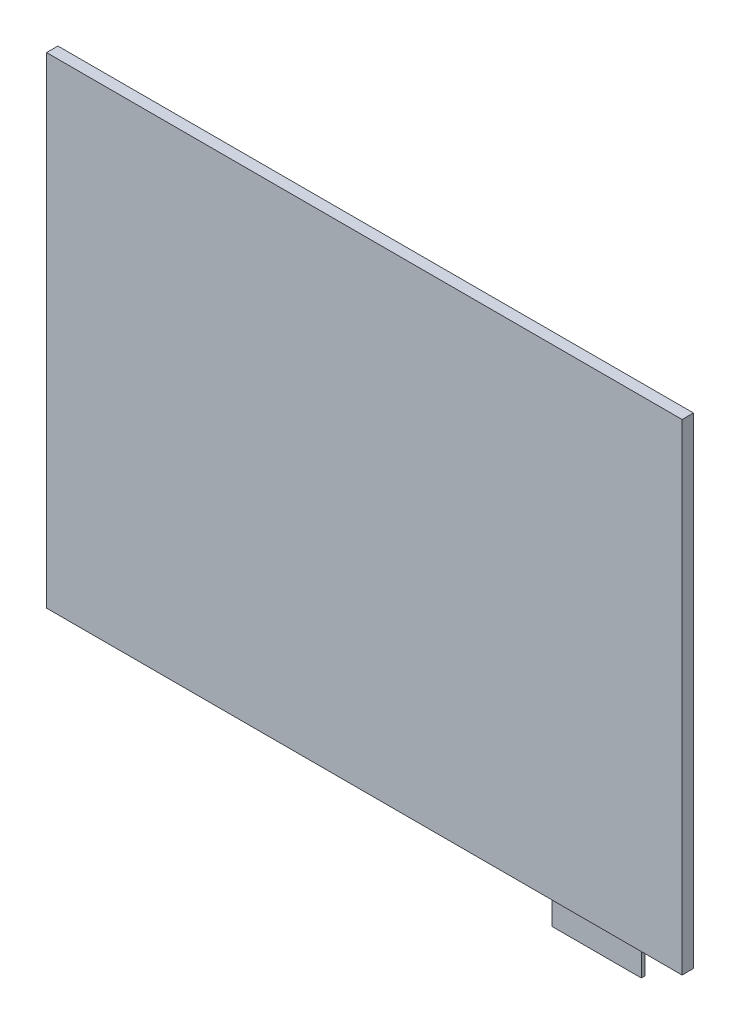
ISO-10303-21;
HEADER;
FILE_DESCRIPTION(('STEP AP214'),'2;1');
FILE_NAME('part.step','',(''),(''),'','','');
FILE_SCHEMA(('AUTOMOTIVE_DESIGN { 1 0 10303 214 1 1 1 1 }'));
ENDSEC;
DATA;
#1=APPLICATION_CONTEXT('core data for automotive mechanical design processes');
#2=APPLICATION_PROTOCOL_DEFINITION('international standard','automotive_design',2000,#1);
#3=PRODUCT_CONTEXT('',#1,'mechanical');
#4=PRODUCT('Part','Part','',(#3));
#5=PRODUCT_RELATED_PRODUCT_CATEGORY('part','',(#4));
#6=PRODUCT_DEFINITION_FORMATION('','',#4);
#7=PRODUCT_DEFINITION_CONTEXT('part definition',#1,'design');
#8=PRODUCT_DEFINITION('design','',#6,#7);
#9=PRODUCT_DEFINITION_SHAPE('','',#8);
#10=(LENGTH_UNIT() NAMED_UNIT(*) SI_UNIT(.MILLI.,.METRE.));
#11=(NAMED_UNIT(*) PLANE_ANGLE_UNIT() SI_UNIT($,.RADIAN.));
#12=(NAMED_UNIT(*) SI_UNIT($,.STERADIAN.) SOLID_ANGLE_UNIT());
#13=UNCERTAINTY_MEASURE_WITH_UNIT(LENGTH_MEASURE(1.E-05),#10,'distance_accuracy_value','');
#14=(GEOMETRIC_REPRESENTATION_CONTEXT(3) GLOBAL_UNCERTAINTY_ASSIGNED_CONTEXT((#13)) GLOBAL_UNIT_ASSIGNED_CONTEXT((#10,
#11,#12)) REPRESENTATION_CONTEXT('',''));
#15=CARTESIAN_POINT('',(0.,0.,0.));
#16=DIRECTION('',(0.,0.,1.));
#17=DIRECTION('',(1.,0.,0.));
#18=AXIS2_PLACEMENT_3D('',#15,#16,#17);
#19=CARTESIAN_POINT('',(177.719768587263,-134.540308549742,6.35));
#20=DIRECTION('',(0.,-1.,0.));
#21=DIRECTION('',(0.,0.,-1.));
#22=AXIS2_PLACEMENT_3D('',#19,#20,#21);
#23=PLANE('',#22);
#24=DIRECTION('',(0.,0.,-1.));
#25=VECTOR('',#24,1.);
#26=CARTESIAN_POINT('',(177.719768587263,-134.540308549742,6.35));
#27=LINE('',#26,#25);
#28=CARTESIAN_POINT('',(177.719768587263,-134.540308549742,6.35));
#29=VERTEX_POINT('',#28);
#30=CARTESIAN_POINT('',(177.719768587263,-134.540308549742,0.));
#31=VERTEX_POINT('',#30);
#32=EDGE_CURVE('E151',#29,#31,#27,.T.);
#33=ORIENTED_EDGE('',*,*,#32,.F.);
#34=DIRECTION('',(-1.,0.,0.));
#35=VECTOR('',#34,1.);
#36=CARTESIAN_POINT('',(177.719768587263,-134.540308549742,6.35));
#37=LINE('',#36,#35);
#38=CARTESIAN_POINT('',(-177.719768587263,-134.540308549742,6.35));
#39=VERTEX_POINT('',#38);
#40=EDGE_CURVE('E143',#29,#39,#37,.T.);
#41=ORIENTED_EDGE('',*,*,#40,.T.);
#42=DIRECTION('',(0.,0.,-1.));
#43=VECTOR('',#42,1.);
#44=CARTESIAN_POINT('',(-177.719768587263,-134.540308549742,6.35));
#45=LINE('',#44,#43);
#46=CARTESIAN_POINT('',(-177.719768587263,-134.540308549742,0.));
#47=VERTEX_POINT('',#46);
#48=EDGE_CURVE('E37',#39,#47,#45,.T.);
#49=ORIENTED_EDGE('',*,*,#48,.T.);
#50=DIRECTION('',(-1.,0.,0.));
#51=VECTOR('',#50,1.);
#52=CARTESIAN_POINT('',(177.719768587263,-134.540308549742,0.));
#53=LINE('',#52,#51);
#54=EDGE_CURVE('E131',#31,#47,#53,.T.);
#55=ORIENTED_EDGE('',*,*,#54,.F.);
#56=EDGE_LOOP('',(#33,#41,#49,#55));
#57=FACE_BOUND('',#56,.T.);
#58=DIRECTION('',(0.,0.,-1.));
#59=VECTOR('',#58,1.);
#60=CARTESIAN_POINT('',(102.719768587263,-134.540308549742,4.17500000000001));
#61=LINE('',#60,#59);
#62=CARTESIAN_POINT('',(102.719768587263,-134.540308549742,4.17500000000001));
#63=VERTEX_POINT('',#62);
#64=CARTESIAN_POINT('',(102.719768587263,-134.540308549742,2.17500000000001));
#65=VERTEX_POINT('',#64);
#66=EDGE_CURVE('E93',#63,#65,#61,.T.);
#67=ORIENTED_EDGE('',*,*,#66,.F.);
#68=DIRECTION('',(1.,0.,0.));
#69=VECTOR('',#68,1.);
#70=CARTESIAN_POINT('',(102.719768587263,-134.540308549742,4.17500000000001));
#71=LINE('',#70,#69);
#72=CARTESIAN_POINT('',(152.719768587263,-134.540308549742,4.17500000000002));
#73=VERTEX_POINT('',#72);
#74=EDGE_CURVE('E44',#63,#73,#71,.T.);
#75=ORIENTED_EDGE('',*,*,#74,.T.);
#76=DIRECTION('',(0.,0.,1.));
#77=VECTOR('',#76,1.);
#78=CARTESIAN_POINT('',(152.719768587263,-134.540308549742,2.17499999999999));
#79=LINE('',#78,#77);
#80=CARTESIAN_POINT('',(152.719768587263,-134.540308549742,2.17499999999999));
#81=VERTEX_POINT('',#80);
#82=EDGE_CURVE('E49',#81,#73,#79,.T.);
#83=ORIENTED_EDGE('',*,*,#82,.F.);
#84=DIRECTION('',(-1.,0.,0.));
#85=VECTOR('',#84,1.);
#86=CARTESIAN_POINT('',(152.719768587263,-134.540308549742,2.17499999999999));
#87=LINE('',#86,#85);
#88=EDGE_CURVE('E90',#81,#65,#87,.T.);
#89=ORIENTED_EDGE('',*,*,#88,.T.);
#90=EDGE_LOOP('',(#67,#75,#83,#89));
#91=FACE_BOUND('',#90,.T.);
#92=ADVANCED_FACE('F29',(#57,#91),#23,.T.);
#93=CARTESIAN_POINT('',(-177.719768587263,134.540308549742,6.35));
#94=DIRECTION('',(0.,1.,0.));
#95=DIRECTION('',(-1.,0.,0.));
#96=AXIS2_PLACEMENT_3D('',#93,#94,#95);
#97=PLANE('',#96);
#98=DIRECTION('',(0.,0.,-1.));
#99=VECTOR('',#98,1.);
#100=CARTESIAN_POINT('',(-177.719768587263,134.540308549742,6.35));
#101=LINE('',#100,#99);
#102=CARTESIAN_POINT('',(-177.719768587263,134.540308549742,6.35));
#103=VERTEX_POINT('',#102);
#104=CARTESIAN_POINT('',(-177.719768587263,134.540308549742,0.));
#105=VERTEX_POINT('',#104);
#106=EDGE_CURVE('E11',#103,#105,#101,.T.);
#107=ORIENTED_EDGE('',*,*,#106,.F.);
#108=DIRECTION('',(1.,0.,0.));
#109=VECTOR('',#108,1.);
#110=CARTESIAN_POINT('',(-177.719768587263,134.540308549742,6.35));
#111=LINE('',#110,#109);
#112=CARTESIAN_POINT('',(177.719768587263,134.540308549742,6.35));
#113=VERTEX_POINT('',#112);
#114=EDGE_CURVE('E137',#103,#113,#111,.T.);
#115=ORIENTED_EDGE('',*,*,#114,.T.);
#116=DIRECTION('',(0.,0.,-1.));
#117=VECTOR('',#116,1.);
#118=CARTESIAN_POINT('',(177.719768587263,134.540308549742,6.35));
#119=LINE('',#118,#117);
#120=CARTESIAN_POINT('',(177.719768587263,134.540308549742,0.));
#121=VERTEX_POINT('',#120);
#122=EDGE_CURVE('E149',#113,#121,#119,.T.);
#123=ORIENTED_EDGE('',*,*,#122,.T.);
#124=DIRECTION('',(1.,0.,0.));
#125=VECTOR('',#124,1.);
#126=CARTESIAN_POINT('',(-177.719768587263,134.540308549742,0.));
#127=LINE('',#126,#125);
#128=EDGE_CURVE('E125',#105,#121,#127,.T.);
#129=ORIENTED_EDGE('',*,*,#128,.F.);
#130=EDGE_LOOP('',(#107,#115,#123,#129));
#131=FACE_BOUND('',#130,.T.);
#132=ADVANCED_FACE('F164',(#131),#97,.T.);
#133=CARTESIAN_POINT('',(-177.719768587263,134.540308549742,6.35));
#134=DIRECTION('',(1.,0.,0.));
#135=DIRECTION('',(0.,0.,-1.));
#136=AXIS2_PLACEMENT_3D('',#133,#134,#135);
#137=PLANE('',#136);
#138=ORIENTED_EDGE('',*,*,#48,.F.);
#139=DIRECTION('',(0.,-1.,0.));
#140=VECTOR('',#139,1.);
#141=CARTESIAN_POINT('',(-177.719768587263,134.540308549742,6.35));
#142=LINE('',#141,#140);
#143=EDGE_CURVE('E146',#103,#39,#142,.T.);
#144=ORIENTED_EDGE('',*,*,#143,.F.);
#145=ORIENTED_EDGE('',*,*,#106,.T.);
#146=DIRECTION('',(0.,-1.,0.));
#147=VECTOR('',#146,1.);
#148=CARTESIAN_POINT('',(-177.719768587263,134.540308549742,0.));
#149=LINE('',#148,#147);
#150=EDGE_CURVE('E134',#105,#47,#149,.T.);
#151=ORIENTED_EDGE('',*,*,#150,.T.);
#152=EDGE_LOOP('',(#138,#144,#145,#151));
#153=FACE_BOUND('',#152,.T.);
#154=ADVANCED_FACE('F31',(#153),#137,.F.);
#155=CARTESIAN_POINT('',(177.719768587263,-134.540308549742,6.35));
#156=DIRECTION('',(-1.,0.,0.));
#157=DIRECTION('',(0.,-1.,0.));
#158=AXIS2_PLACEMENT_3D('',#155,#156,#157);
#159=PLANE('',#158);
#160=DIRECTION('',(0.,1.,0.));
#161=VECTOR('',#160,1.);
#162=CARTESIAN_POINT('',(177.719768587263,-134.540308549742,6.35));
#163=LINE('',#162,#161);
#164=EDGE_CURVE('E140',#29,#113,#163,.T.);
#165=ORIENTED_EDGE('',*,*,#164,.F.);
#166=ORIENTED_EDGE('',*,*,#32,.T.);
#167=DIRECTION('',(0.,1.,0.));
#168=VECTOR('',#167,1.);
#169=CARTESIAN_POINT('',(177.719768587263,-134.540308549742,0.));
#170=LINE('',#169,#168);
#171=EDGE_CURVE('E128',#31,#121,#170,.T.);
#172=ORIENTED_EDGE('',*,*,#171,.T.);
#173=ORIENTED_EDGE('',*,*,#122,.F.);
#174=EDGE_LOOP('',(#165,#166,#172,#173));
#175=FACE_BOUND('',#174,.T.);
#176=ADVANCED_FACE('F167',(#175),#159,.F.);
#177=CARTESIAN_POINT('',(177.719768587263,134.540308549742,6.35));
#178=DIRECTION('',(0.,0.,1.));
#179=DIRECTION('',(1.,0.,0.));
#180=AXIS2_PLACEMENT_3D('',#177,#178,#179);
#181=PLANE('',#180);
#182=ORIENTED_EDGE('',*,*,#114,.F.);
#183=ORIENTED_EDGE('',*,*,#143,.T.);
#184=ORIENTED_EDGE('',*,*,#40,.F.);
#185=ORIENTED_EDGE('',*,*,#164,.T.);
#186=EDGE_LOOP('',(#182,#183,#184,#185));
#187=FACE_BOUND('',#186,.T.);
#188=ADVANCED_FACE('F169',(#187),#181,.T.);
#189=CARTESIAN_POINT('',(177.719768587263,134.540308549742,0.));
#190=DIRECTION('',(0.,0.,1.));
#191=DIRECTION('',(1.,0.,0.));
#192=AXIS2_PLACEMENT_3D('',#189,#190,#191);
#193=PLANE('',#192);
#194=ORIENTED_EDGE('',*,*,#128,.T.);
#195=ORIENTED_EDGE('',*,*,#171,.F.);
#196=ORIENTED_EDGE('',*,*,#54,.T.);
#197=ORIENTED_EDGE('',*,*,#150,.F.);
#198=EDGE_LOOP('',(#194,#195,#196,#197));
#199=FACE_BOUND('',#198,.T.);
#200=ADVANCED_FACE('F160',(#199),#193,.F.);
#201=CARTESIAN_POINT('',(102.719768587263,-149.540308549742,4.17500000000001));
#202=DIRECTION('',(0.,0.,1.));
#203=DIRECTION('',(1.,0.,0.));
#204=AXIS2_PLACEMENT_3D('',#201,#202,#203);
#205=PLANE('',#204);
#206=DIRECTION('',(0.,1.,0.));
#207=VECTOR('',#206,1.);
#208=CARTESIAN_POINT('',(102.719768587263,-149.540308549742,4.17500000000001));
#209=LINE('',#208,#207);
#210=CARTESIAN_POINT('',(102.719768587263,-149.540308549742,4.17500000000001));
#211=VERTEX_POINT('',#210);
#212=EDGE_CURVE('E105',#211,#63,#209,.T.);
#213=ORIENTED_EDGE('',*,*,#212,.F.);
#214=DIRECTION('',(1.,0.,0.));
#215=VECTOR('',#214,1.);
#216=CARTESIAN_POINT('',(102.719768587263,-149.540308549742,4.17500000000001));
#217=LINE('',#216,#215);
#218=CARTESIAN_POINT('',(152.719768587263,-149.540308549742,4.17500000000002));
#219=VERTEX_POINT('',#218);
#220=EDGE_CURVE('E109',#211,#219,#217,.T.);
#221=ORIENTED_EDGE('',*,*,#220,.T.);
#222=DIRECTION('',(0.,1.,0.));
#223=VECTOR('',#222,1.);
#224=CARTESIAN_POINT('',(152.719768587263,-149.540308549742,4.17500000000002));
#225=LINE('',#224,#223);
#226=EDGE_CURVE('E121',#219,#73,#225,.T.);
#227=ORIENTED_EDGE('',*,*,#226,.T.);
#228=ORIENTED_EDGE('',*,*,#74,.F.);
#229=EDGE_LOOP('',(#213,#221,#227,#228));
#230=FACE_BOUND('',#229,.T.);
#231=ADVANCED_FACE('F176',(#230),#205,.T.);
#232=CARTESIAN_POINT('',(102.719768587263,-149.540308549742,4.17500000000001));
#233=DIRECTION('',(1.,0.,0.));
#234=DIRECTION('',(0.,1.,0.));
#235=AXIS2_PLACEMENT_3D('',#232,#233,#234);
#236=PLANE('',#235);
#237=DIRECTION('',(0.,1.,0.));
#238=VECTOR('',#237,1.);
#239=CARTESIAN_POINT('',(102.719768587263,-149.540308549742,2.17500000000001));
#240=LINE('',#239,#238);
#241=CARTESIAN_POINT('',(102.719768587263,-149.540308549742,2.17500000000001));
#242=VERTEX_POINT('',#241);
#243=EDGE_CURVE('E98',#242,#65,#240,.T.);
#244=ORIENTED_EDGE('',*,*,#243,.F.);
#245=DIRECTION('',(0.,0.,-1.));
#246=VECTOR('',#245,1.);
#247=CARTESIAN_POINT('',(102.719768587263,-149.540308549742,4.17500000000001));
#248=LINE('',#247,#246);
#249=EDGE_CURVE('E119',#211,#242,#248,.T.);
#250=ORIENTED_EDGE('',*,*,#249,.F.);
#251=ORIENTED_EDGE('',*,*,#212,.T.);
#252=ORIENTED_EDGE('',*,*,#66,.T.);
#253=EDGE_LOOP('',(#244,#250,#251,#252));
#254=FACE_BOUND('',#253,.T.);
#255=ADVANCED_FACE('F108',(#254),#236,.F.);
#256=CARTESIAN_POINT('',(152.719768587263,-149.540308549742,2.17499999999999));
#257=DIRECTION('',(0.,0.,-1.));
#258=DIRECTION('',(-1.,0.,0.));
#259=AXIS2_PLACEMENT_3D('',#256,#257,#258);
#260=PLANE('',#259);
#261=DIRECTION('',(0.,1.,0.));
#262=VECTOR('',#261,1.);
#263=CARTESIAN_POINT('',(152.719768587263,-149.540308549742,2.17499999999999));
#264=LINE('',#263,#262);
#265=CARTESIAN_POINT('',(152.719768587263,-149.540308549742,2.17499999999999));
#266=VERTEX_POINT('',#265);
#267=EDGE_CURVE('E106',#266,#81,#264,.T.);
#268=ORIENTED_EDGE('',*,*,#267,.F.);
#269=DIRECTION('',(-1.,0.,0.));
#270=VECTOR('',#269,1.);
#271=CARTESIAN_POINT('',(152.719768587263,-149.540308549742,2.17499999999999));
#272=LINE('',#271,#270);
#273=EDGE_CURVE('E101',#266,#242,#272,.T.);
#274=ORIENTED_EDGE('',*,*,#273,.T.);
#275=ORIENTED_EDGE('',*,*,#243,.T.);
#276=ORIENTED_EDGE('',*,*,#88,.F.);
#277=EDGE_LOOP('',(#268,#274,#275,#276));
#278=FACE_BOUND('',#277,.T.);
#279=ADVANCED_FACE('F99',(#278),#260,.T.);
#280=CARTESIAN_POINT('',(152.719768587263,-149.540308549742,2.17499999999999));
#281=DIRECTION('',(-1.,0.,0.));
#282=DIRECTION('',(0.,-1.,0.));
#283=AXIS2_PLACEMENT_3D('',#280,#281,#282);
#284=PLANE('',#283);
#285=DIRECTION('',(0.,0.,1.));
#286=VECTOR('',#285,1.);
#287=CARTESIAN_POINT('',(152.719768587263,-149.540308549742,2.17499999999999));
#288=LINE('',#287,#286);
#289=EDGE_CURVE('E112',#266,#219,#288,.T.);
#290=ORIENTED_EDGE('',*,*,#289,.F.);
#291=ORIENTED_EDGE('',*,*,#267,.T.);
#292=ORIENTED_EDGE('',*,*,#82,.T.);
#293=ORIENTED_EDGE('',*,*,#226,.F.);
#294=EDGE_LOOP('',(#290,#291,#292,#293));
#295=FACE_BOUND('',#294,.T.);
#296=ADVANCED_FACE('F232',(#295),#284,.F.);
#297=CARTESIAN_POINT('',(152.719768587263,-149.540308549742,4.17500000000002));
#298=DIRECTION('',(0.,-1.,0.));
#299=DIRECTION('',(0.,0.,-1.));
#300=AXIS2_PLACEMENT_3D('',#297,#298,#299);
#301=PLANE('',#300);
#302=ORIENTED_EDGE('',*,*,#220,.F.);
#303=ORIENTED_EDGE('',*,*,#249,.T.);
#304=ORIENTED_EDGE('',*,*,#273,.F.);
#305=ORIENTED_EDGE('',*,*,#289,.T.);
#306=EDGE_LOOP('',(#302,#303,#304,#305));
#307=FACE_BOUND('',#306,.T.);
#308=ADVANCED_FACE('F234',(#307),#301,.T.);
#309=CLOSED_SHELL('',(#92,#132,#154,#176,#188,#200,#231,#255,#279,#296,#308));
#310=MANIFOLD_SOLID_BREP('B2',#309);
#311=ADVANCED_BREP_SHAPE_REPRESENTATION('',(#18,#310),#14);
#312=SHAPE_DEFINITION_REPRESENTATION(#9,#311);
ENDSEC;
END-ISO-10303-21;
